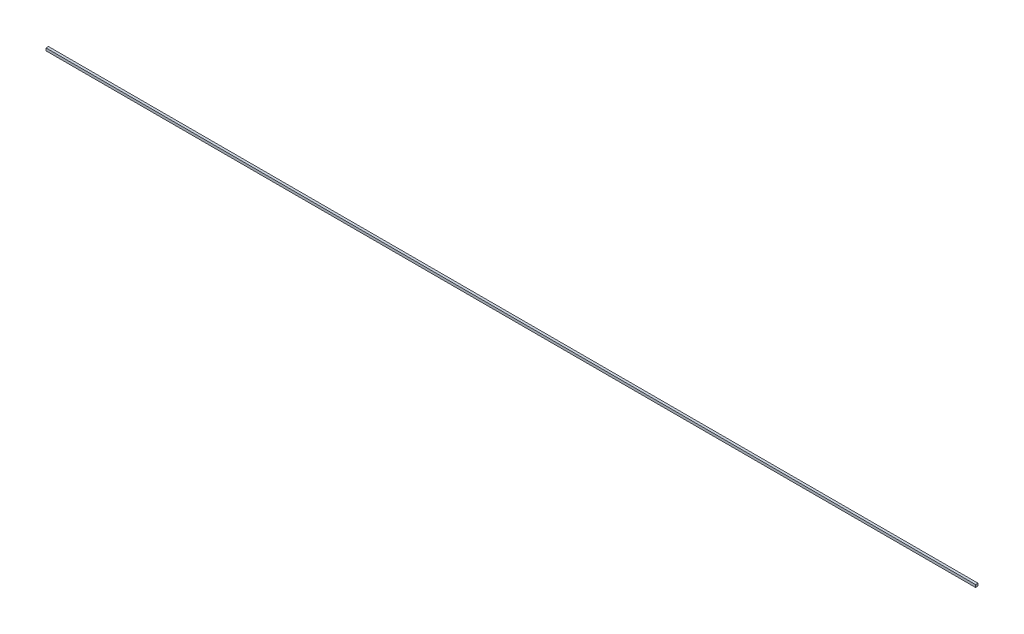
from build123d import *

# Parameters (mm, degrees)
SKETCH1_W      = 0.6
SKETCH1_H      = 0.62
EXTRUDE1_DEPTH = 113.203


with BuildPart() as part:
    # Sketch1 → Extrude1 (new, symmetric)
    with BuildSketch(Plane(origin=(0, 0, 0), x_dir=(0, 0, -1), z_dir=(1, 0, 0))):
        with Locations((0, 0.31)):
            Rectangle(SKETCH1_W, SKETCH1_H)
    extrude(amount=EXTRUDE1_DEPTH, both=True)


solid = part.part
